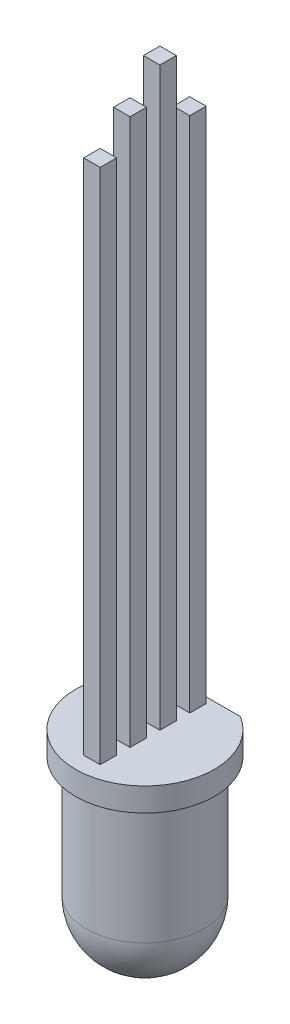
from build123d import *

# Parameters (mm, degrees)
ENL_V_MAT_EXTRU_1_REACH = 10.67
ESQUISSE3_W             = 0.7
ESQUISSE3_H             = 0.7
BOSS_EXTRU_1_DEPTH      = 24.5
ENL_V_START             = -3.3
ENL_V_MAT_EXTRU_2_DEPTH = 5.9


with BuildPart() as part:
    # Esquisse1 → R_volution1 (revolve)
    with BuildSketch(Plane.XY):
        with BuildLine():
            Line((2.5, 7.6), (2.5, 2.5))
            ThreePointArc((2.5, 2.5), (1.767766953, 0.732233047), (0, 0))
            Line((0, 0), (0, 8.6))
            Line((0, 8.6), (2.95, 8.6))
            Line((2.95, 8.6), (2.95, 7.6))
            Line((2.95, 7.6), (2.5, 7.6))
        make_face()
    revolve(axis=Axis((0, 0, 0), (0, 1, 0)))

    # Esquisse2 → Enl_v. mat.-Extru.1 (cut, up to next)
    with BuildSketch(Plane(origin=(0, 7.6, 0), x_dir=(-1, 0, 0), z_dir=(0, -1, 0)), mode=Mode.PRIVATE) as enl_v_mat_extru_1_sk1:
        Polygon((2.031643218, 2.5), (-2.119175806, 2.5), (-0.304277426, 5.41579693), align=None)
    enl_v_mat_extru_1_tool1 = extrude(enl_v_mat_extru_1_sk1.sketch, amount=-ENL_V_MAT_EXTRU_1_REACH, mode=Mode.PRIVATE) & part.part
    add(enl_v_mat_extru_1_tool1.solids().sort_by_distance((0.130603, 7.6, -3.471932))[0], mode=Mode.SUBTRACT)

    # Esquisse3 → Boss.-Extru.1 (add)
    with BuildSketch(Plane(origin=(0, 8.6, 0), x_dir=(1, 0, 0), z_dir=(0, 1, 0))):
        with Locations((0, 1.905)):
            Rectangle(ESQUISSE3_W, ESQUISSE3_H)
        with Locations((0, -0.635)):
            Rectangle(ESQUISSE3_W, ESQUISSE3_H)
        with Locations((0, -1.905)):
            Rectangle(ESQUISSE3_W, ESQUISSE3_H)
        with Locations((0, 0.635)):
            Rectangle(ESQUISSE3_W, ESQUISSE3_H)
    extrude(amount=BOSS_EXTRU_1_DEPTH)

    # Esquisse4 → Enl_v. mat.-Extru.2 (cut)
    with BuildSketch(Plane.ZY.offset(0.35).offset(ENL_V_START)):
        Polygon((-2.885095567, 30.6), (-1.265657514, 30.6), (-1.265657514, 33.921907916), (0, 33.921907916), (0, 31.83), (1.344412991, 31.83), (1.344412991, 30.6), (2.897512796, 30.6), (2.897512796, 34.676886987), (-2.885095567, 34.676886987), align=None)
    extrude(amount=ENL_V_MAT_EXTRU_2_DEPTH, mode=Mode.SUBTRACT)


solid = part.part
